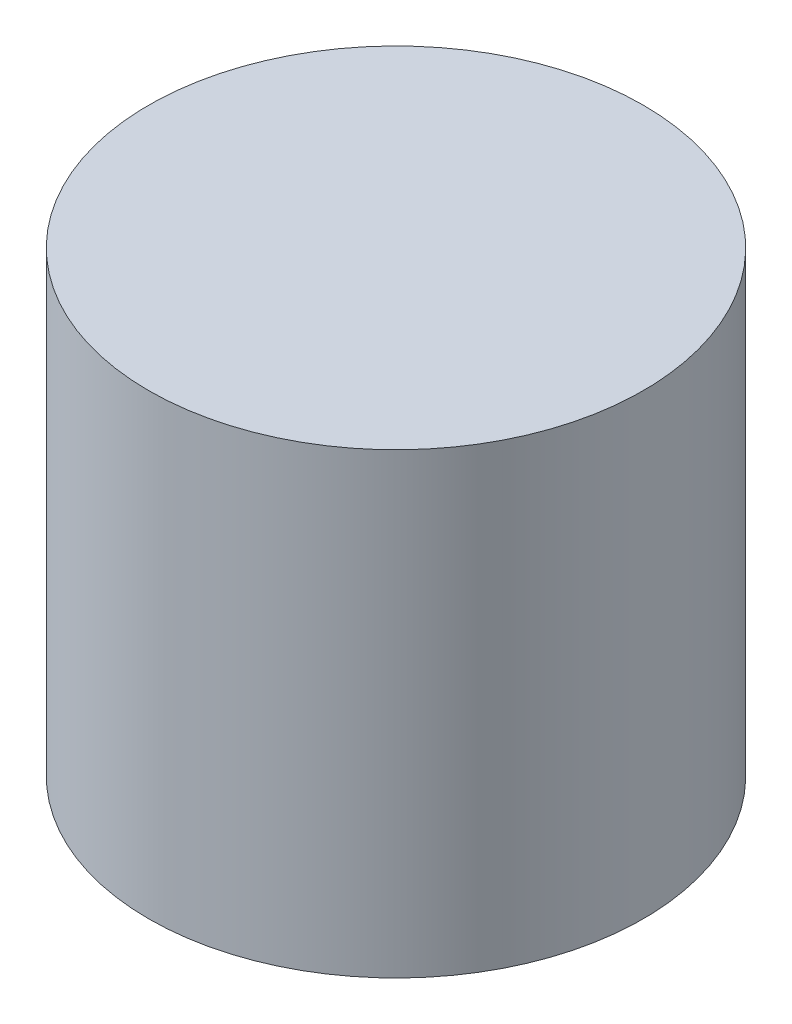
from build123d import *

# Parameters (mm, degrees)
SKETCH1_R           = 10
BOSS_EXTRUDE1_DEPTH = 18.5


with BuildPart() as part:
    # Sketch1 → Boss-Extrude1 (new body)
    with BuildSketch(Plane(origin=(0, 0, 0), x_dir=(1, 0, 0), z_dir=(0, 1, 0))):
        with Locations(Location((0, 0, 0), (0, 0, 270))):
            Circle(SKETCH1_R)
    extrude(amount=BOSS_EXTRUDE1_DEPTH)


solid = part.part
